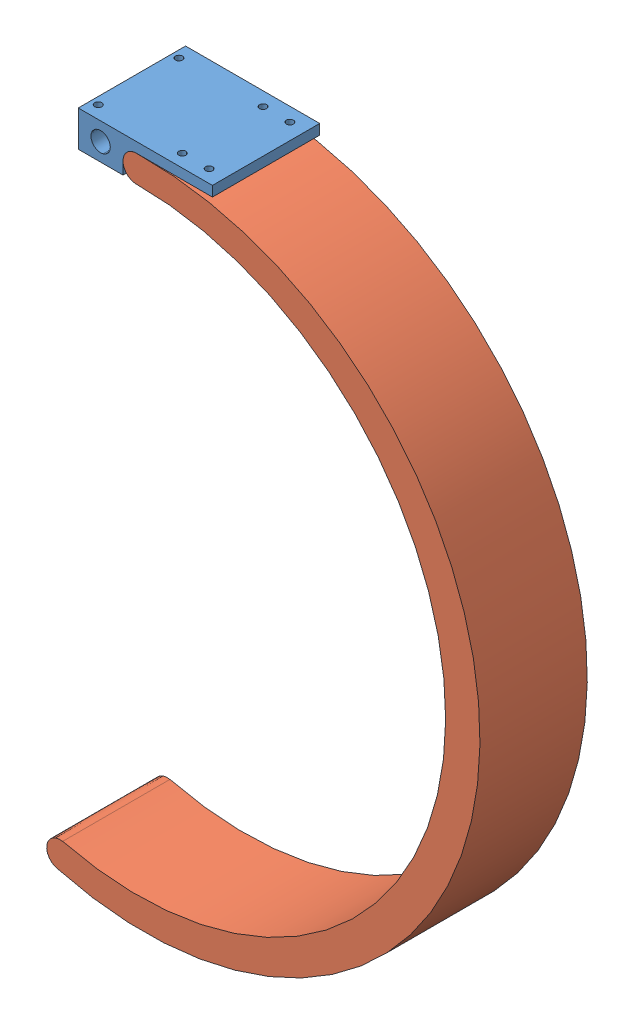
SolidWorks assembly Leg attachment+Leg.SLDASM, configuration Default (file format 7000). Lengths in mm.
Overall size (152.95 209.79 30.48).
2 component instances, 2 part files, 2 mates.
Components (placement in the parent):
- Leg attachment-2: Leg attachment.SLDPRT [Default] at (-15.6447 8.4512 13.9257) size (38.1 10.16 30.48)
- Leg-2: Leg.SLDPRT [Default] at (-33.3206 -82.7333 44.4057) x (-0.981655 0.190667 0) z (0 0 -1) size (118.81 190.5 30.48)
Mates (geometry in assembly coordinates):
- Concentric1: concentric anti-aligned: cylinder of Leg attachment-2 through (-26.2589 6.8785 44.4057) axis (0 0 -1) radius 3.81; cylinder of Leg-2 through (-26.2589 6.8785 13.9257) axis (0 0 1) radius 3.8194
- Coincident1: coincident aligned: plane of Leg attachment-2 through (-26.2589 6.8785 44.4057) normal (0 0 1); plane of Leg-2 through (-35.9189 -128.6808 44.4057) normal (0 0 1)
